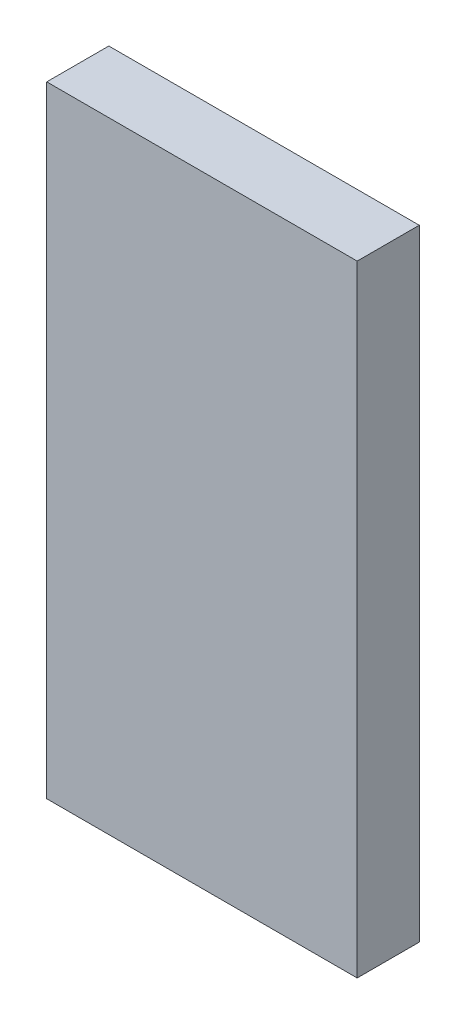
ISO-10303-21;
HEADER;
FILE_DESCRIPTION(('STEP AP214'),'2;1');
FILE_NAME('part.step','',(''),(''),'','','');
FILE_SCHEMA(('AUTOMOTIVE_DESIGN { 1 0 10303 214 1 1 1 1 }'));
ENDSEC;
DATA;
#1=APPLICATION_CONTEXT('core data for automotive mechanical design processes');
#2=APPLICATION_PROTOCOL_DEFINITION('international standard','automotive_design',2000,#1);
#3=PRODUCT_CONTEXT('',#1,'mechanical');
#4=PRODUCT('Part','Part','',(#3));
#5=PRODUCT_RELATED_PRODUCT_CATEGORY('part','',(#4));
#6=PRODUCT_DEFINITION_FORMATION('','',#4);
#7=PRODUCT_DEFINITION_CONTEXT('part definition',#1,'design');
#8=PRODUCT_DEFINITION('design','',#6,#7);
#9=PRODUCT_DEFINITION_SHAPE('','',#8);
#10=(LENGTH_UNIT() NAMED_UNIT(*) SI_UNIT(.MILLI.,.METRE.));
#11=(NAMED_UNIT(*) PLANE_ANGLE_UNIT() SI_UNIT($,.RADIAN.));
#12=(NAMED_UNIT(*) SI_UNIT($,.STERADIAN.) SOLID_ANGLE_UNIT());
#13=UNCERTAINTY_MEASURE_WITH_UNIT(LENGTH_MEASURE(1.E-05),#10,'distance_accuracy_value','');
#14=(GEOMETRIC_REPRESENTATION_CONTEXT(3) GLOBAL_UNCERTAINTY_ASSIGNED_CONTEXT((#13)) GLOBAL_UNIT_ASSIGNED_CONTEXT((#10,
#11,#12)) REPRESENTATION_CONTEXT('',''));
#15=CARTESIAN_POINT('',(0.,0.,0.));
#16=DIRECTION('',(0.,0.,1.));
#17=DIRECTION('',(1.,0.,0.));
#18=AXIS2_PLACEMENT_3D('',#15,#16,#17);
#19=CARTESIAN_POINT('',(0.,0.,30.));
#20=DIRECTION('',(0.,0.,1.));
#21=DIRECTION('',(1.,0.,0.));
#22=AXIS2_PLACEMENT_3D('',#19,#20,#21);
#23=PLANE('',#22);
#24=DIRECTION('',(1.,0.,0.));
#25=VECTOR('',#24,1.);
#26=CARTESIAN_POINT('',(-75.,-150.,30.));
#27=LINE('',#26,#25);
#28=CARTESIAN_POINT('',(-75.,-150.,30.));
#29=VERTEX_POINT('',#28);
#30=CARTESIAN_POINT('',(75.,-150.,30.));
#31=VERTEX_POINT('',#30);
#32=EDGE_CURVE('E79',#29,#31,#27,.T.);
#33=ORIENTED_EDGE('',*,*,#32,.T.);
#34=DIRECTION('',(0.,1.,0.));
#35=VECTOR('',#34,1.);
#36=CARTESIAN_POINT('',(75.,-150.,30.));
#37=LINE('',#36,#35);
#38=CARTESIAN_POINT('',(75.,150.,30.));
#39=VERTEX_POINT('',#38);
#40=EDGE_CURVE('E104',#31,#39,#37,.T.);
#41=ORIENTED_EDGE('',*,*,#40,.T.);
#42=DIRECTION('',(-1.,0.,0.));
#43=VECTOR('',#42,1.);
#44=CARTESIAN_POINT('',(75.,150.,30.));
#45=LINE('',#44,#43);
#46=CARTESIAN_POINT('',(-75.,150.,30.));
#47=VERTEX_POINT('',#46);
#48=EDGE_CURVE('E72',#39,#47,#45,.T.);
#49=ORIENTED_EDGE('',*,*,#48,.T.);
#50=DIRECTION('',(0.,-1.,0.));
#51=VECTOR('',#50,1.);
#52=CARTESIAN_POINT('',(-75.,150.,30.));
#53=LINE('',#52,#51);
#54=EDGE_CURVE('E10',#47,#29,#53,.T.);
#55=ORIENTED_EDGE('',*,*,#54,.T.);
#56=EDGE_LOOP('',(#33,#41,#49,#55));
#57=FACE_BOUND('',#56,.T.);
#58=ADVANCED_FACE('F16',(#57),#23,.T.);
#59=CARTESIAN_POINT('',(0.,0.,0.));
#60=DIRECTION('',(0.,0.,1.));
#61=DIRECTION('',(1.,0.,0.));
#62=AXIS2_PLACEMENT_3D('',#59,#60,#61);
#63=PLANE('',#62);
#64=DIRECTION('',(0.,-1.,0.));
#65=VECTOR('',#64,1.);
#66=CARTESIAN_POINT('',(-75.,150.,0.));
#67=LINE('',#66,#65);
#68=CARTESIAN_POINT('',(-75.,150.,0.));
#69=VERTEX_POINT('',#68);
#70=CARTESIAN_POINT('',(-75.,-150.,0.));
#71=VERTEX_POINT('',#70);
#72=EDGE_CURVE('E19',#69,#71,#67,.T.);
#73=ORIENTED_EDGE('',*,*,#72,.F.);
#74=DIRECTION('',(-1.,0.,0.));
#75=VECTOR('',#74,1.);
#76=CARTESIAN_POINT('',(75.,150.,0.));
#77=LINE('',#76,#75);
#78=CARTESIAN_POINT('',(75.,150.,0.));
#79=VERTEX_POINT('',#78);
#80=EDGE_CURVE('E94',#79,#69,#77,.T.);
#81=ORIENTED_EDGE('',*,*,#80,.F.);
#82=DIRECTION('',(0.,1.,0.));
#83=VECTOR('',#82,1.);
#84=CARTESIAN_POINT('',(75.,-150.,0.));
#85=LINE('',#84,#83);
#86=CARTESIAN_POINT('',(75.,-150.,0.));
#87=VERTEX_POINT('',#86);
#88=EDGE_CURVE('E81',#87,#79,#85,.T.);
#89=ORIENTED_EDGE('',*,*,#88,.F.);
#90=DIRECTION('',(1.,0.,0.));
#91=VECTOR('',#90,1.);
#92=CARTESIAN_POINT('',(-75.,-150.,0.));
#93=LINE('',#92,#91);
#94=EDGE_CURVE('E77',#71,#87,#93,.T.);
#95=ORIENTED_EDGE('',*,*,#94,.F.);
#96=EDGE_LOOP('',(#73,#81,#89,#95));
#97=FACE_BOUND('',#96,.T.);
#98=ADVANCED_FACE('F83',(#97),#63,.F.);
#99=CARTESIAN_POINT('',(-75.,150.,0.));
#100=DIRECTION('',(1.,0.,0.));
#101=DIRECTION('',(0.,1.,0.));
#102=AXIS2_PLACEMENT_3D('',#99,#100,#101);
#103=PLANE('',#102);
#104=ORIENTED_EDGE('',*,*,#72,.T.);
#105=DIRECTION('',(0.,0.,1.));
#106=VECTOR('',#105,1.);
#107=CARTESIAN_POINT('',(-75.,-150.,0.));
#108=LINE('',#107,#106);
#109=EDGE_CURVE('E64',#71,#29,#108,.T.);
#110=ORIENTED_EDGE('',*,*,#109,.T.);
#111=ORIENTED_EDGE('',*,*,#54,.F.);
#112=DIRECTION('',(0.,0.,1.));
#113=VECTOR('',#112,1.);
#114=CARTESIAN_POINT('',(-75.,150.,0.));
#115=LINE('',#114,#113);
#116=EDGE_CURVE('E67',#69,#47,#115,.T.);
#117=ORIENTED_EDGE('',*,*,#116,.F.);
#118=EDGE_LOOP('',(#104,#110,#111,#117));
#119=FACE_BOUND('',#118,.T.);
#120=ADVANCED_FACE('F63',(#119),#103,.F.);
#121=CARTESIAN_POINT('',(75.,150.,0.));
#122=DIRECTION('',(0.,-1.,0.));
#123=DIRECTION('',(0.,0.,-1.));
#124=AXIS2_PLACEMENT_3D('',#121,#122,#123);
#125=PLANE('',#124);
#126=ORIENTED_EDGE('',*,*,#80,.T.);
#127=ORIENTED_EDGE('',*,*,#116,.T.);
#128=ORIENTED_EDGE('',*,*,#48,.F.);
#129=DIRECTION('',(0.,0.,1.));
#130=VECTOR('',#129,1.);
#131=CARTESIAN_POINT('',(75.,150.,0.));
#132=LINE('',#131,#130);
#133=EDGE_CURVE('E100',#79,#39,#132,.T.);
#134=ORIENTED_EDGE('',*,*,#133,.F.);
#135=EDGE_LOOP('',(#126,#127,#128,#134));
#136=FACE_BOUND('',#135,.T.);
#137=ADVANCED_FACE('F114',(#136),#125,.F.);
#138=CARTESIAN_POINT('',(75.,-150.,0.));
#139=DIRECTION('',(-1.,0.,0.));
#140=DIRECTION('',(0.,0.,1.));
#141=AXIS2_PLACEMENT_3D('',#138,#139,#140);
#142=PLANE('',#141);
#143=ORIENTED_EDGE('',*,*,#88,.T.);
#144=ORIENTED_EDGE('',*,*,#133,.T.);
#145=ORIENTED_EDGE('',*,*,#40,.F.);
#146=DIRECTION('',(0.,0.,1.));
#147=VECTOR('',#146,1.);
#148=CARTESIAN_POINT('',(75.,-150.,0.));
#149=LINE('',#148,#147);
#150=EDGE_CURVE('E87',#87,#31,#149,.T.);
#151=ORIENTED_EDGE('',*,*,#150,.F.);
#152=EDGE_LOOP('',(#143,#144,#145,#151));
#153=FACE_BOUND('',#152,.T.);
#154=ADVANCED_FACE('F120',(#153),#142,.F.);
#155=CARTESIAN_POINT('',(-75.,-150.,0.));
#156=DIRECTION('',(0.,1.,0.));
#157=DIRECTION('',(1.,0.,0.));
#158=AXIS2_PLACEMENT_3D('',#155,#156,#157);
#159=PLANE('',#158);
#160=ORIENTED_EDGE('',*,*,#94,.T.);
#161=ORIENTED_EDGE('',*,*,#150,.T.);
#162=ORIENTED_EDGE('',*,*,#32,.F.);
#163=ORIENTED_EDGE('',*,*,#109,.F.);
#164=EDGE_LOOP('',(#160,#161,#162,#163));
#165=FACE_BOUND('',#164,.T.);
#166=ADVANCED_FACE('F75',(#165),#159,.F.);
#167=CLOSED_SHELL('',(#58,#98,#120,#137,#154,#166));
#168=MANIFOLD_SOLID_BREP('B1',#167);
#169=ADVANCED_BREP_SHAPE_REPRESENTATION('',(#18,#168),#14);
#170=SHAPE_DEFINITION_REPRESENTATION(#9,#169);
ENDSEC;
END-ISO-10303-21;
